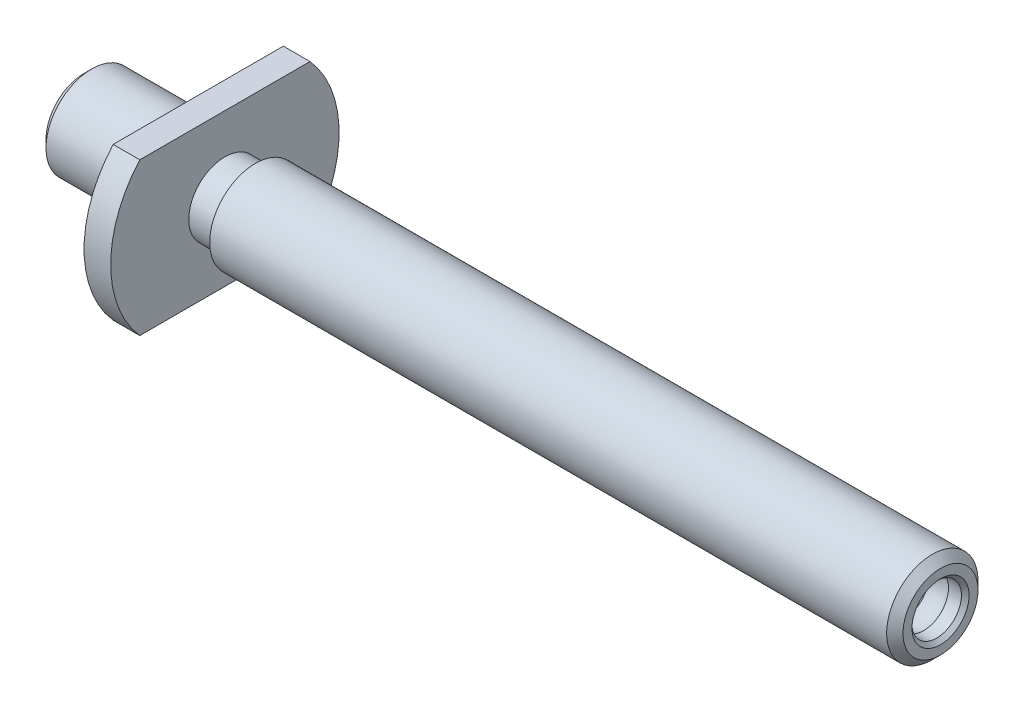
from build123d import *

# Parameters (mm, degrees)
CHANFREIN2_SIZE    = 1
M_PLATS_DEPTH      = 97.363893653
M_PLATS_DEPTH_BACK = 97.363893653


with BuildPart() as part:
    # Esquisse1 → Forme de r_volution (revolve)
    with BuildSketch(Plane.XY, mode=Mode.PRIVATE) as forme_de_r_volution_sk:
        with BuildLine():
            Line((-15, 0), (89.91678311, 0))
            Line((89.91678311, 0), (91.869580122, 3.25))
            Line((91.869580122, 3.25), (92.700961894, 3.25))
            ThreePointArc((92.700961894, 3.25), (94, 3.5), (95.299038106, 3.25))
            Line((95.299038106, 3.25), (97, 3.25))
            Line((97, 3.25), (97.5, 3.75))
            Line((97.5, 3.75), (97.5, 4.92655))
            Line((97.5, 4.92655), (96.42655, 6))
            Line((96.42655, 6), (7.5, 6))
            Line((7.5, 6), (7.5, 4.75))
            Line((7.5, 4.75), (3.5, 4.75))
            Line((3.5, 4.75), (3.5, 15))
            Line((3.5, 15), (0, 15))
            Line((0, 15), (0, 6))
            Line((0, 6), (-15, 6))
            Line((-15, 6), (-15, 0))
        make_face()
    revolve(forme_de_r_volution_sk.sketch.rotate(Axis((110.666531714, 0, 0), (-1, 0, 0)), 90), axis=Axis((110.666531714, 0, 0), (-1, 0, 0)))

    # Chanfrein2
    chanfrein2_edges = [part.edges().sort_by_distance(p)[0] for p in [
        (-15, 0, 6),
    ]]
    chamfer(chanfrein2_edges, length=CHANFREIN2_SIZE)

    # Esquisse3 → M_plats (cut, two sides: drawn at the far end of the back side and taken through both)
    with BuildSketch(Plane(origin=(3.5, 0, 0), x_dir=(0, 0, -1), z_dir=(1, 0, 0)).offset(-M_PLATS_DEPTH_BACK)):
        Polygon((-103.669154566, 10), (-15.223201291, 10), (13.534968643, 10), (101.980921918, 10), (101.980921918, 186.891906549), (-103.669154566, 186.891906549), align=None)
    m_plats = extrude(amount=M_PLATS_DEPTH + M_PLATS_DEPTH_BACK, mode=Mode.SUBTRACT)

    # Sym_trie1: M_plats across plane
    add(m_plats.mirror(Plane.ZX), mode=Mode.SUBTRACT)


solid = part.part
